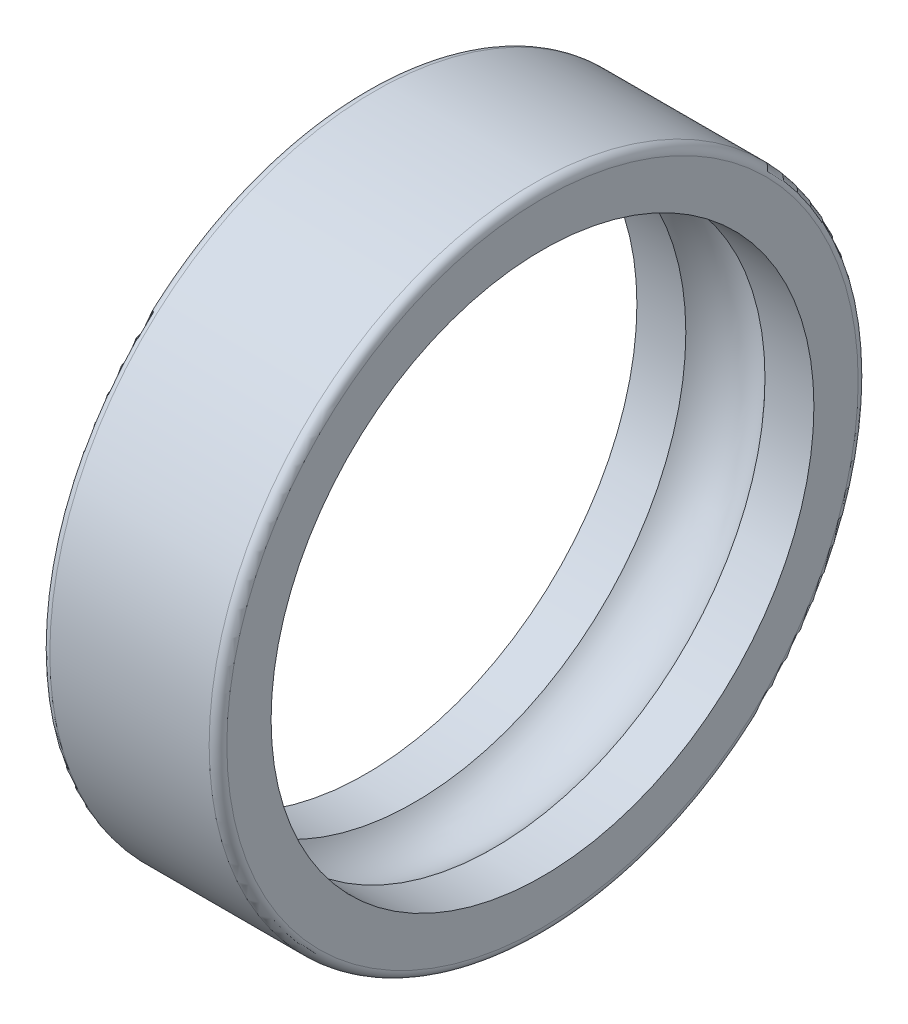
from build123d import *


with BuildPart() as part:
    # Esquisse1 → Base-R_volution (revolve)
    with BuildSketch(Plane(origin=(0, 0, 0), x_dir=(1, 0, 0), z_dir=(0, 1, 0)), mode=Mode.PRIVATE) as base_r_volution_sk:
        with BuildLine():
            Line((0, 5.35), (0, 4.6))
            Line((0, 4.6), (0.829179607, 4.6))
            ThreePointArc((0.829179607, 4.6), (1.5, 4.9), (2.170820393, 4.6))
            Line((2.170820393, 4.6), (3, 4.6))
            Line((3, 4.6), (3, 5.35))
            ThreePointArc((3, 5.35), (2.956066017, 5.456066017), (2.85, 5.5))
            Line((2.85, 5.5), (0.15, 5.5))
            ThreePointArc((0.15, 5.5), (0.043933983, 5.456066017), (0, 5.35))
        make_face()
    revolve(base_r_volution_sk.sketch.rotate(Axis((0, 0, 0), (1, 0, 0)), 180), axis=Axis((0, 0, 0), (1, 0, 0)))


solid = part.part
